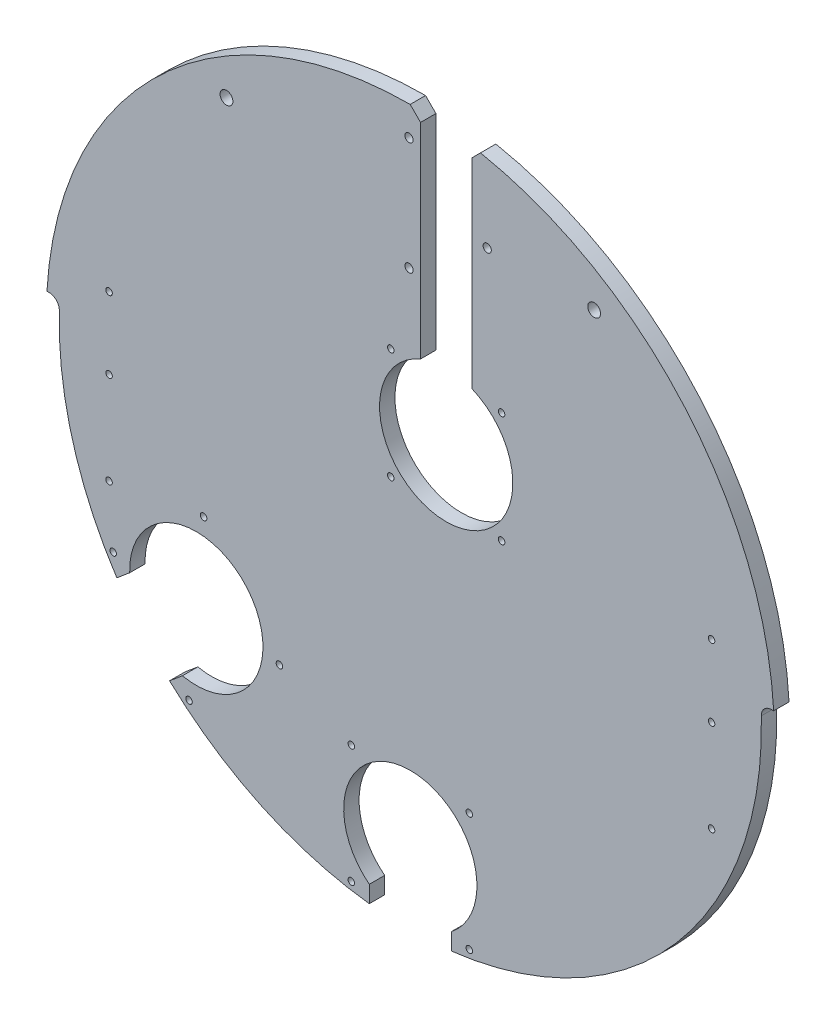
ISO-10303-21;
HEADER;
FILE_DESCRIPTION(('STEP AP214'),'2;1');
FILE_NAME('part.step','',(''),(''),'','','');
FILE_SCHEMA(('AUTOMOTIVE_DESIGN { 1 0 10303 214 1 1 1 1 }'));
ENDSEC;
DATA;
#1=APPLICATION_CONTEXT('core data for automotive mechanical design processes');
#2=APPLICATION_PROTOCOL_DEFINITION('international standard','automotive_design',2000,#1);
#3=PRODUCT_CONTEXT('',#1,'mechanical');
#4=PRODUCT('Part','Part','',(#3));
#5=PRODUCT_RELATED_PRODUCT_CATEGORY('part','',(#4));
#6=PRODUCT_DEFINITION_FORMATION('','',#4);
#7=PRODUCT_DEFINITION_CONTEXT('part definition',#1,'design');
#8=PRODUCT_DEFINITION('design','',#6,#7);
#9=PRODUCT_DEFINITION_SHAPE('','',#8);
#10=(LENGTH_UNIT() NAMED_UNIT(*) SI_UNIT(.MILLI.,.METRE.));
#11=(NAMED_UNIT(*) PLANE_ANGLE_UNIT() SI_UNIT($,.RADIAN.));
#12=(NAMED_UNIT(*) SI_UNIT($,.STERADIAN.) SOLID_ANGLE_UNIT());
#13=UNCERTAINTY_MEASURE_WITH_UNIT(LENGTH_MEASURE(1.E-05),#10,'distance_accuracy_value','');
#14=(GEOMETRIC_REPRESENTATION_CONTEXT(3) GLOBAL_UNCERTAINTY_ASSIGNED_CONTEXT((#13)) GLOBAL_UNIT_ASSIGNED_CONTEXT((#10,
#11,#12)) REPRESENTATION_CONTEXT('',''));
#15=CARTESIAN_POINT('',(0.,0.,0.));
#16=DIRECTION('',(0.,0.,1.));
#17=DIRECTION('',(1.,0.,0.));
#18=AXIS2_PLACEMENT_3D('',#15,#16,#17);
#19=CARTESIAN_POINT('',(0.,0.,4.7625));
#20=DIRECTION('',(0.,0.,-1.));
#21=DIRECTION('',(-1.,0.,0.));
#22=AXIS2_PLACEMENT_3D('',#19,#20,#21);
#23=CYLINDRICAL_SURFACE('',#22,217.4875);
#24=CARTESIAN_POINT('',(0.,0.,4.7625));
#25=DIRECTION('',(0.,0.,1.));
#26=DIRECTION('',(1.,0.,0.));
#27=AXIS2_PLACEMENT_3D('',#24,#25,#26);
#28=CIRCLE('',#27,217.4875);
#29=CARTESIAN_POINT('',(-149.138178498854,-158.299135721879,4.7625));
#30=VERTEX_POINT('',#29);
#31=CARTESIAN_POINT('',(-25.4,-215.999195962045,4.7625));
#32=VERTEX_POINT('',#31);
#33=EDGE_CURVE('E246',#30,#32,#28,.T.);
#34=ORIENTED_EDGE('',*,*,#33,.F.);
#35=DIRECTION('',(0.,0.,-1.));
#36=VECTOR('',#35,1.);
#37=CARTESIAN_POINT('',(-149.138178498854,-158.299135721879,4.7625));
#38=LINE('',#37,#36);
#39=CARTESIAN_POINT('',(-149.138178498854,-158.299135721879,-4.7625));
#40=VERTEX_POINT('',#39);
#41=EDGE_CURVE('E392',#30,#40,#38,.T.);
#42=ORIENTED_EDGE('',*,*,#41,.T.);
#43=CARTESIAN_POINT('',(0.,0.,-4.7625));
#44=DIRECTION('',(0.,0.,1.));
#45=DIRECTION('',(1.,0.,0.));
#46=AXIS2_PLACEMENT_3D('',#43,#44,#45);
#47=CIRCLE('',#46,217.4875);
#48=CARTESIAN_POINT('',(-25.4,-215.999195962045,-4.7625));
#49=VERTEX_POINT('',#48);
#50=EDGE_CURVE('E251',#40,#49,#47,.T.);
#51=ORIENTED_EDGE('',*,*,#50,.T.);
#52=DIRECTION('',(0.,0.,-1.));
#53=VECTOR('',#52,1.);
#54=CARTESIAN_POINT('',(-25.4,-215.999195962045,4.7625));
#55=LINE('',#54,#53);
#56=EDGE_CURVE('E403',#49,#32,#55,.F.);
#57=ORIENTED_EDGE('',*,*,#56,.T.);
#58=EDGE_LOOP('',(#34,#42,#51,#57));
#59=FACE_BOUND('',#58,.T.);
#60=ADVANCED_FACE('F41',(#59),#23,.T.);
#61=CARTESIAN_POINT('',(25.4,-215.999195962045,4.7625));
#62=VERTEX_POINT('',#61);
#63=CARTESIAN_POINT('',(217.399966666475,6.16985815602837,4.7625));
#64=VERTEX_POINT('',#63);
#65=EDGE_CURVE('E247',#62,#64,#28,.T.);
#66=ORIENTED_EDGE('',*,*,#65,.F.);
#67=DIRECTION('',(0.,0.,-1.));
#68=VECTOR('',#67,1.);
#69=CARTESIAN_POINT('',(25.4,-215.999195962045,4.7625));
#70=LINE('',#69,#68);
#71=CARTESIAN_POINT('',(25.4,-215.999195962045,-4.7625));
#72=VERTEX_POINT('',#71);
#73=EDGE_CURVE('E408',#62,#72,#70,.T.);
#74=ORIENTED_EDGE('',*,*,#73,.T.);
#75=CARTESIAN_POINT('',(217.399966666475,6.16985815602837,-4.7625));
#76=VERTEX_POINT('',#75);
#77=EDGE_CURVE('E243',#72,#76,#47,.T.);
#78=ORIENTED_EDGE('',*,*,#77,.T.);
#79=DIRECTION('',(0.,0.,-1.));
#80=VECTOR('',#79,1.);
#81=CARTESIAN_POINT('',(217.399966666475,6.16985815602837,4.7625));
#82=LINE('',#81,#80);
#83=EDGE_CURVE('E253',#76,#64,#82,.F.);
#84=ORIENTED_EDGE('',*,*,#83,.T.);
#85=EDGE_LOOP('',(#66,#74,#78,#84));
#86=FACE_BOUND('',#85,.T.);
#87=ADVANCED_FACE('F528',(#86),#23,.T.);
#88=CARTESIAN_POINT('',(0.,0.,-502.630442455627));
#89=DIRECTION('',(0.,0.,1.));
#90=DIRECTION('',(1.,0.,0.));
#91=AXIS2_PLACEMENT_3D('',#88,#89,#90);
#92=CYLINDRICAL_SURFACE('',#91,225.425);
#93=CARTESIAN_POINT('',(0.,0.,-4.7625));
#94=DIRECTION('',(0.,0.,1.));
#95=DIRECTION('',(1.,0.,0.));
#96=AXIS2_PLACEMENT_3D('',#93,#94,#95);
#97=CIRCLE('',#96,225.425);
#98=CARTESIAN_POINT('',(43.463360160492,221.195314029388,-4.7625));
#99=VERTEX_POINT('',#98);
#100=CARTESIAN_POINT('',(225.06696920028,12.7,-4.7625));
#101=VERTEX_POINT('',#100);
#102=EDGE_CURVE('E304',#99,#101,#97,.F.);
#103=ORIENTED_EDGE('',*,*,#102,.F.);
#104=DIRECTION('',(0.,0.,1.));
#105=VECTOR('',#104,1.);
#106=CARTESIAN_POINT('',(43.463360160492,221.195314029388,-502.630442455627));
#107=LINE('',#106,#105);
#108=CARTESIAN_POINT('',(43.463360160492,221.195314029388,4.7625));
#109=VERTEX_POINT('',#108);
#110=EDGE_CURVE('E186',#99,#109,#107,.T.);
#111=ORIENTED_EDGE('',*,*,#110,.T.);
#112=CARTESIAN_POINT('',(0.,0.,4.7625));
#113=DIRECTION('',(0.,0.,1.));
#114=DIRECTION('',(1.,0.,0.));
#115=AXIS2_PLACEMENT_3D('',#112,#113,#114);
#116=CIRCLE('',#115,225.425);
#117=CARTESIAN_POINT('',(225.06696920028,12.7,4.7625));
#118=VERTEX_POINT('',#117);
#119=EDGE_CURVE('E303',#118,#109,#116,.T.);
#120=ORIENTED_EDGE('',*,*,#119,.F.);
#121=DIRECTION('',(0.,0.,1.));
#122=VECTOR('',#121,1.);
#123=CARTESIAN_POINT('',(225.06696920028,12.7,-502.630442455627));
#124=LINE('',#123,#122);
#125=EDGE_CURVE('E360',#101,#118,#124,.T.);
#126=ORIENTED_EDGE('',*,*,#125,.F.);
#127=EDGE_LOOP('',(#103,#111,#120,#126));
#128=FACE_BOUND('',#127,.T.);
#129=ADVANCED_FACE('F301',(#128),#92,.T.);
#130=CARTESIAN_POINT('',(-217.399966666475,6.16985815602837,-4.7625));
#131=VERTEX_POINT('',#130);
#132=CARTESIAN_POINT('',(-181.79178907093,-119.384078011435,-4.7625));
#133=VERTEX_POINT('',#132);
#134=EDGE_CURVE('E248',#131,#133,#47,.T.);
#135=ORIENTED_EDGE('',*,*,#134,.T.);
#136=DIRECTION('',(0.,0.,-1.));
#137=VECTOR('',#136,1.);
#138=CARTESIAN_POINT('',(-181.79178907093,-119.384078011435,4.7625));
#139=LINE('',#138,#137);
#140=CARTESIAN_POINT('',(-181.79178907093,-119.384078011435,4.7625));
#141=VERTEX_POINT('',#140);
#142=EDGE_CURVE('E544',#133,#141,#139,.F.);
#143=ORIENTED_EDGE('',*,*,#142,.T.);
#144=CARTESIAN_POINT('',(-217.399966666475,6.16985815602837,4.7625));
#145=VERTEX_POINT('',#144);
#146=EDGE_CURVE('E194',#145,#141,#28,.T.);
#147=ORIENTED_EDGE('',*,*,#146,.F.);
#148=DIRECTION('',(0.,0.,-1.));
#149=VECTOR('',#148,1.);
#150=CARTESIAN_POINT('',(-217.399966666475,6.16985815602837,4.7625));
#151=LINE('',#150,#149);
#152=EDGE_CURVE('E245',#145,#131,#151,.T.);
#153=ORIENTED_EDGE('',*,*,#152,.T.);
#154=EDGE_LOOP('',(#135,#143,#147,#153));
#155=FACE_BOUND('',#154,.T.);
#156=ADVANCED_FACE('F493',(#155),#23,.T.);
#157=CARTESIAN_POINT('',(0.,0.,4.7625));
#158=DIRECTION('',(0.,0.,1.));
#159=DIRECTION('',(1.,0.,0.));
#160=AXIS2_PLACEMENT_3D('',#157,#158,#159);
#161=PLANE('',#160);
#162=CARTESIAN_POINT('',(-0.79375,207.16875,4.7625));
#163=DIRECTION('',(0.,0.,1.));
#164=DIRECTION('',(1.,0.,0.));
#165=AXIS2_PLACEMENT_3D('',#162,#163,#164);
#166=CIRCLE('',#165,2.55269999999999);
#167=CARTESIAN_POINT('',(1.75894999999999,207.16875,4.7625));
#168=VERTEX_POINT('',#167);
#169=EDGE_CURVE('E977',#168,#168,#166,.T.);
#170=ORIENTED_EDGE('',*,*,#169,.F.);
#171=EDGE_LOOP('',(#170));
#172=FACE_BOUND('',#171,.T.);
#173=CARTESIAN_POINT('',(-0.79375,137.31875,4.7625));
#174=DIRECTION('',(0.,0.,1.));
#175=DIRECTION('',(1.,0.,0.));
#176=AXIS2_PLACEMENT_3D('',#173,#174,#175);
#177=CIRCLE('',#176,2.55269999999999);
#178=CARTESIAN_POINT('',(1.75894999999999,137.31875,4.7625));
#179=VERTEX_POINT('',#178);
#180=EDGE_CURVE('E981',#179,#179,#177,.T.);
#181=ORIENTED_EDGE('',*,*,#180,.F.);
#182=EDGE_LOOP('',(#181));
#183=FACE_BOUND('',#182,.T.);
#184=CARTESIAN_POINT('',(47.625,172.24375,4.7625));
#185=DIRECTION('',(0.,0.,1.));
#186=DIRECTION('',(1.,0.,0.));
#187=AXIS2_PLACEMENT_3D('',#184,#185,#186);
#188=CIRCLE('',#187,2.55269999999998);
#189=CARTESIAN_POINT('',(50.1777,172.24375,4.7625));
#190=VERTEX_POINT('',#189);
#191=EDGE_CURVE('E989',#190,#190,#188,.T.);
#192=ORIENTED_EDGE('',*,*,#191,.F.);
#193=EDGE_LOOP('',(#192));
#194=FACE_BOUND('',#193,.T.);
#195=DIRECTION('',(0.766044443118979,0.642787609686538,0.));
#196=VECTOR('',#195,1.);
#197=CARTESIAN_POINT('',(-150.278285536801,-159.255799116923,4.7625));
#198=LINE('',#197,#196);
#199=CARTESIAN_POINT('',(-141.150152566,-151.596386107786,4.7625));
#200=VERTEX_POINT('',#199);
#201=EDGE_CURVE('E56',#30,#200,#198,.T.);
#202=ORIENTED_EDGE('',*,*,#201,.F.);
#203=ORIENTED_EDGE('',*,*,#33,.T.);
#204=DIRECTION('',(0.,-1.,0.));
#205=VECTOR('',#204,1.);
#206=CARTESIAN_POINT('',(-25.4,-205.289158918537,4.7625));
#207=LINE('',#206,#205);
#208=CARTESIAN_POINT('',(-25.4,-205.571568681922,4.7625));
#209=VERTEX_POINT('',#208);
#210=EDGE_CURVE('E387',#209,#32,#207,.T.);
#211=ORIENTED_EDGE('',*,*,#210,.F.);
#212=CARTESIAN_POINT('',(0.,-173.0375,4.7625));
#213=DIRECTION('',(0.,0.,1.));
#214=DIRECTION('',(1.,0.,0.));
#215=AXIS2_PLACEMENT_3D('',#212,#213,#214);
#216=CIRCLE('',#215,41.275);
#217=CARTESIAN_POINT('',(25.4,-205.571568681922,4.7625));
#218=VERTEX_POINT('',#217);
#219=EDGE_CURVE('E204',#218,#209,#216,.T.);
#220=ORIENTED_EDGE('',*,*,#219,.F.);
#221=DIRECTION('',(0.,1.,0.));
#222=VECTOR('',#221,1.);
#223=CARTESIAN_POINT('',(25.4,-217.4875,4.7625));
#224=LINE('',#223,#222);
#225=EDGE_CURVE('E384',#62,#218,#224,.T.);
#226=ORIENTED_EDGE('',*,*,#225,.F.);
#227=ORIENTED_EDGE('',*,*,#65,.T.);
#228=CARTESIAN_POINT('',(223.747410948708,6.35,4.7625));
#229=DIRECTION('',(0.,0.,1.));
#230=DIRECTION('',(1.,0.,0.));
#231=AXIS2_PLACEMENT_3D('',#228,#229,#230);
#232=CIRCLE('',#231,6.35);
#233=CARTESIAN_POINT('',(223.747410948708,12.7,4.7625));
#234=VERTEX_POINT('',#233);
#235=EDGE_CURVE('E261',#64,#234,#232,.F.);
#236=ORIENTED_EDGE('',*,*,#235,.T.);
#237=DIRECTION('',(1.,0.,0.));
#238=VECTOR('',#237,1.);
#239=CARTESIAN_POINT('',(217.116380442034,12.7,4.7625));
#240=LINE('',#239,#238);
#241=EDGE_CURVE('E310',#234,#118,#240,.T.);
#242=ORIENTED_EDGE('',*,*,#241,.T.);
#243=ORIENTED_EDGE('',*,*,#119,.T.);
#244=DIRECTION('',(-0.707106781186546,-0.707106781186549,0.));
#245=VECTOR('',#244,1.);
#246=CARTESIAN_POINT('',(-88.8659769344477,88.8659769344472,4.7625));
#247=LINE('',#246,#245);
#248=CARTESIAN_POINT('',(38.1,215.831953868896,4.7625));
#249=VERTEX_POINT('',#248);
#250=EDGE_CURVE('E280',#109,#249,#247,.T.);
#251=ORIENTED_EDGE('',*,*,#250,.T.);
#252=DIRECTION('',(0.,1.,0.));
#253=VECTOR('',#252,1.);
#254=CARTESIAN_POINT('',(38.1,53.975,4.7625));
#255=LINE('',#254,#253);
#256=CARTESIAN_POINT('',(38.1,92.075,4.7625));
#257=VERTEX_POINT('',#256);
#258=EDGE_CURVE('E321',#257,#249,#255,.T.);
#259=ORIENTED_EDGE('',*,*,#258,.F.);
#260=CARTESIAN_POINT('',(22.225,53.975,4.7625));
#261=DIRECTION('',(0.,0.,1.));
#262=DIRECTION('',(1.,0.,0.));
#263=AXIS2_PLACEMENT_3D('',#260,#261,#262);
#264=CIRCLE('',#263,41.275);
#265=CARTESIAN_POINT('',(6.34999999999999,92.075,4.7625));
#266=VERTEX_POINT('',#265);
#267=EDGE_CURVE('E374',#266,#257,#264,.T.);
#268=ORIENTED_EDGE('',*,*,#267,.F.);
#269=DIRECTION('',(0.,-1.,0.));
#270=VECTOR('',#269,1.);
#271=CARTESIAN_POINT('',(6.34999999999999,225.425,4.7625));
#272=LINE('',#271,#270);
#273=CARTESIAN_POINT('',(6.34999999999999,218.985545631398,4.7625));
#274=VERTEX_POINT('',#273);
#275=EDGE_CURVE('E339',#274,#266,#272,.T.);
#276=ORIENTED_EDGE('',*,*,#275,.F.);
#277=DIRECTION('',(0.707106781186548,-0.707106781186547,0.));
#278=VECTOR('',#277,1.);
#279=CARTESIAN_POINT('',(112.667772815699,112.667772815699,4.7625));
#280=LINE('',#279,#278);
#281=CARTESIAN_POINT('',(-0.0894366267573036,225.424982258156,4.7625));
#282=VERTEX_POINT('',#281);
#283=EDGE_CURVE('E282',#274,#282,#280,.F.);
#284=ORIENTED_EDGE('',*,*,#283,.T.);
#285=CARTESIAN_POINT('',(-225.06696920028,12.7,4.7625));
#286=VERTEX_POINT('',#285);
#287=EDGE_CURVE('E313',#282,#286,#116,.T.);
#288=ORIENTED_EDGE('',*,*,#287,.T.);
#289=DIRECTION('',(1.,0.,0.));
#290=VECTOR('',#289,1.);
#291=CARTESIAN_POINT('',(-225.06696920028,12.7,4.7625));
#292=LINE('',#291,#290);
#293=CARTESIAN_POINT('',(-223.747410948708,12.7,4.7625));
#294=VERTEX_POINT('',#293);
#295=EDGE_CURVE('E312',#286,#294,#292,.T.);
#296=ORIENTED_EDGE('',*,*,#295,.T.);
#297=CARTESIAN_POINT('',(-223.747410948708,6.35,4.7625));
#298=DIRECTION('',(0.,0.,1.));
#299=DIRECTION('',(1.,0.,0.));
#300=AXIS2_PLACEMENT_3D('',#297,#298,#299);
#301=CIRCLE('',#300,6.35);
#302=EDGE_CURVE('E266',#294,#145,#301,.F.);
#303=ORIENTED_EDGE('',*,*,#302,.T.);
#304=ORIENTED_EDGE('',*,*,#146,.T.);
#305=DIRECTION('',(-0.766044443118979,-0.642787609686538,0.));
#306=VECTOR('',#305,1.);
#307=CARTESIAN_POINT('',(-173.587424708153,-112.499798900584,4.7625));
#308=LINE('',#307,#306);
#309=CARTESIAN_POINT('',(-173.803763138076,-112.681328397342,4.7625));
#310=VERTEX_POINT('',#309);
#311=EDGE_CURVE('E180',#310,#141,#308,.T.);
#312=ORIENTED_EDGE('',*,*,#311,.F.);
#313=CARTESIAN_POINT('',(-132.5544153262,-111.226361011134,4.7625));
#314=DIRECTION('',(0.,0.,1.));
#315=DIRECTION('',(1.,0.,0.));
#316=AXIS2_PLACEMENT_3D('',#313,#314,#315);
#317=CIRCLE('',#316,41.2749999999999);
#318=EDGE_CURVE('E192',#200,#310,#317,.T.);
#319=ORIENTED_EDGE('',*,*,#318,.F.);
#320=EDGE_LOOP('',(#202,#203,#211,#220,#226,#227,#236,#242,#243,#251,#259,#268,#276,#284,#288,
#296,#303,#304,#312,#319));
#321=FACE_BOUND('',#320,.T.);
#322=CARTESIAN_POINT('',(-184.046723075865,-106.721367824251,4.7625));
#323=DIRECTION('',(0.,0.,1.));
#324=DIRECTION('',(1.,0.,0.));
#325=AXIS2_PLACEMENT_3D('',#322,#323,#324);
#326=CIRCLE('',#325,2.0193);
#327=CARTESIAN_POINT('',(-182.027423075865,-106.721367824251,4.7625));
#328=VERTEX_POINT('',#327);
#329=EDGE_CURVE('E411',#328,#328,#326,.T.);
#330=ORIENTED_EDGE('',*,*,#329,.F.);
#331=EDGE_LOOP('',(#330));
#332=FACE_BOUND('',#331,.T.);
#333=CARTESIAN_POINT('',(56.529578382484,19.6704216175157,4.7625));
#334=DIRECTION('',(0.,0.,1.));
#335=DIRECTION('',(1.,0.,0.));
#336=AXIS2_PLACEMENT_3D('',#333,#334,#335);
#337=CIRCLE('',#336,2.01929999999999);
#338=CARTESIAN_POINT('',(58.548878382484,19.6704216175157,4.7625));
#339=VERTEX_POINT('',#338);
#340=EDGE_CURVE('E417',#339,#339,#337,.T.);
#341=ORIENTED_EDGE('',*,*,#340,.F.);
#342=EDGE_LOOP('',(#341));
#343=FACE_BOUND('',#342,.T.);
#344=CARTESIAN_POINT('',(-137.059408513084,-162.718668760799,4.7625));
#345=DIRECTION('',(0.,0.,1.));
#346=DIRECTION('',(1.,0.,0.));
#347=AXIS2_PLACEMENT_3D('',#344,#345,#346);
#348=CIRCLE('',#347,2.0193);
#349=CARTESIAN_POINT('',(-135.040108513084,-162.718668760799,4.7625));
#350=VERTEX_POINT('',#349);
#351=EDGE_CURVE('E423',#350,#350,#348,.T.);
#352=ORIENTED_EDGE('',*,*,#351,.F.);
#353=EDGE_LOOP('',(#352));
#354=FACE_BOUND('',#353,.T.);
#355=CARTESIAN_POINT('',(-128.049422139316,-59.7340532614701,4.7625));
#356=DIRECTION('',(0.,0.,1.));
#357=DIRECTION('',(1.,0.,0.));
#358=AXIS2_PLACEMENT_3D('',#355,#356,#357);
#359=CIRCLE('',#358,2.01929999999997);
#360=CARTESIAN_POINT('',(-126.030122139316,-59.7340532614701,4.7625));
#361=VERTEX_POINT('',#360);
#362=EDGE_CURVE('E429',#361,#361,#359,.T.);
#363=ORIENTED_EDGE('',*,*,#362,.F.);
#364=EDGE_LOOP('',(#363));
#365=FACE_BOUND('',#364,.T.);
#366=CARTESIAN_POINT('',(-81.0621075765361,-115.731354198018,4.7625));
#367=DIRECTION('',(0.,0.,1.));
#368=DIRECTION('',(1.,0.,0.));
#369=AXIS2_PLACEMENT_3D('',#366,#367,#368);
#370=CIRCLE('',#369,2.01929999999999);
#371=CARTESIAN_POINT('',(-79.0428075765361,-115.731354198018,4.7625));
#372=VERTEX_POINT('',#371);
#373=EDGE_CURVE('E435',#372,#372,#370,.T.);
#374=ORIENTED_EDGE('',*,*,#373,.F.);
#375=EDGE_LOOP('',(#374));
#376=FACE_BOUND('',#375,.T.);
#377=CARTESIAN_POINT('',(-12.0795783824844,19.670421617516,4.7625));
#378=DIRECTION('',(0.,0.,1.));
#379=DIRECTION('',(1.,0.,0.));
#380=AXIS2_PLACEMENT_3D('',#377,#378,#379);
#381=CIRCLE('',#380,2.01929999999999);
#382=CARTESIAN_POINT('',(-10.0602783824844,19.670421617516,4.7625));
#383=VERTEX_POINT('',#382);
#384=EDGE_CURVE('E441',#383,#383,#381,.T.);
#385=ORIENTED_EDGE('',*,*,#384,.F.);
#386=EDGE_LOOP('',(#385));
#387=FACE_BOUND('',#386,.T.);
#388=CARTESIAN_POINT('',(56.5295783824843,88.279578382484,4.7625));
#389=DIRECTION('',(0.,0.,1.));
#390=DIRECTION('',(1.,0.,0.));
#391=AXIS2_PLACEMENT_3D('',#388,#389,#390);
#392=CIRCLE('',#391,2.01929999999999);
#393=CARTESIAN_POINT('',(58.5488783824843,88.279578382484,4.7625));
#394=VERTEX_POINT('',#393);
#395=EDGE_CURVE('E447',#394,#394,#392,.T.);
#396=ORIENTED_EDGE('',*,*,#395,.F.);
#397=EDGE_LOOP('',(#396));
#398=FACE_BOUND('',#397,.T.);
#399=CARTESIAN_POINT('',(-12.079578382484,88.2795783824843,4.7625));
#400=DIRECTION('',(0.,0.,1.));
#401=DIRECTION('',(1.,0.,0.));
#402=AXIS2_PLACEMENT_3D('',#399,#400,#401);
#403=CIRCLE('',#402,2.01929999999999);
#404=CARTESIAN_POINT('',(-10.060278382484,88.2795783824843,4.7625));
#405=VERTEX_POINT('',#404);
#406=EDGE_CURVE('E453',#405,#405,#403,.T.);
#407=ORIENTED_EDGE('',*,*,#406,.F.);
#408=EDGE_LOOP('',(#407));
#409=FACE_BOUND('',#408,.T.);
#410=CARTESIAN_POINT('',(36.5496424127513,-209.587142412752,4.7625));
#411=DIRECTION('',(0.,0.,1.));
#412=DIRECTION('',(1.,0.,0.));
#413=AXIS2_PLACEMENT_3D('',#410,#411,#412);
#414=CIRCLE('',#413,2.01929999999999);
#415=CARTESIAN_POINT('',(38.5689424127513,-209.587142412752,4.7625));
#416=VERTEX_POINT('',#415);
#417=EDGE_CURVE('E459',#416,#416,#414,.T.);
#418=ORIENTED_EDGE('',*,*,#417,.F.);
#419=EDGE_LOOP('',(#418));
#420=FACE_BOUND('',#419,.T.);
#421=CARTESIAN_POINT('',(-36.5496424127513,-209.587142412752,4.7625));
#422=DIRECTION('',(0.,0.,1.));
#423=DIRECTION('',(1.,0.,0.));
#424=AXIS2_PLACEMENT_3D('',#421,#422,#423);
#425=CIRCLE('',#424,2.01929999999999);
#426=CARTESIAN_POINT('',(-34.5303424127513,-209.587142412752,4.7625));
#427=VERTEX_POINT('',#426);
#428=EDGE_CURVE('E465',#427,#427,#425,.T.);
#429=ORIENTED_EDGE('',*,*,#428,.F.);
#430=EDGE_LOOP('',(#429));
#431=FACE_BOUND('',#430,.T.);
#432=CARTESIAN_POINT('',(-36.5496424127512,-136.487857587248,4.7625));
#433=DIRECTION('',(0.,0.,1.));
#434=DIRECTION('',(1.,0.,0.));
#435=AXIS2_PLACEMENT_3D('',#432,#433,#434);
#436=CIRCLE('',#435,2.01929999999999);
#437=CARTESIAN_POINT('',(-34.5303424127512,-136.487857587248,4.7625));
#438=VERTEX_POINT('',#437);
#439=EDGE_CURVE('E471',#438,#438,#436,.T.);
#440=ORIENTED_EDGE('',*,*,#439,.F.);
#441=EDGE_LOOP('',(#440));
#442=FACE_BOUND('',#441,.T.);
#443=CARTESIAN_POINT('',(36.5496424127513,-136.487857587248,4.7625));
#444=DIRECTION('',(0.,0.,1.));
#445=DIRECTION('',(1.,0.,0.));
#446=AXIS2_PLACEMENT_3D('',#443,#444,#445);
#447=CIRCLE('',#446,2.01929999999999);
#448=CARTESIAN_POINT('',(38.5689424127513,-136.487857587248,4.7625));
#449=VERTEX_POINT('',#448);
#450=EDGE_CURVE('E477',#449,#449,#447,.T.);
#451=ORIENTED_EDGE('',*,*,#450,.F.);
#452=EDGE_LOOP('',(#451));
#453=FACE_BOUND('',#452,.T.);
#454=CARTESIAN_POINT('',(113.869240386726,172.11750846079,4.7625));
#455=DIRECTION('',(0.,0.,1.));
#456=DIRECTION('',(1.,0.,0.));
#457=AXIS2_PLACEMENT_3D('',#454,#455,#456);
#458=CIRCLE('',#457,3.96874999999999);
#459=CARTESIAN_POINT('',(117.837990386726,172.11750846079,4.7625));
#460=VERTEX_POINT('',#459);
#461=EDGE_CURVE('E345',#460,#460,#458,.T.);
#462=ORIENTED_EDGE('',*,*,#461,.F.);
#463=EDGE_LOOP('',(#462));
#464=FACE_BOUND('',#463,.T.);
#465=CARTESIAN_POINT('',(-113.869240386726,172.11750846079,4.7625));
#466=DIRECTION('',(0.,0.,1.));
#467=DIRECTION('',(1.,0.,0.));
#468=AXIS2_PLACEMENT_3D('',#465,#466,#467);
#469=CIRCLE('',#468,3.96874999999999);
#470=CARTESIAN_POINT('',(-109.900490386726,172.11750846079,4.7625));
#471=VERTEX_POINT('',#470);
#472=EDGE_CURVE('E351',#471,#471,#469,.T.);
#473=ORIENTED_EDGE('',*,*,#472,.F.);
#474=EDGE_LOOP('',(#473));
#475=FACE_BOUND('',#474,.T.);
#476=CARTESIAN_POINT('',(-186.59475,-69.85,4.7625));
#477=DIRECTION('',(0.,0.,1.));
#478=DIRECTION('',(1.,0.,0.));
#479=AXIS2_PLACEMENT_3D('',#476,#477,#478);
#480=CIRCLE('',#479,2.0193);
#481=CARTESIAN_POINT('',(-184.57545,-69.85,4.7625));
#482=VERTEX_POINT('',#481);
#483=EDGE_CURVE('E201',#482,#482,#480,.T.);
#484=ORIENTED_EDGE('',*,*,#483,.F.);
#485=EDGE_LOOP('',(#484));
#486=FACE_BOUND('',#485,.T.);
#487=CARTESIAN_POINT('',(-186.59475,31.75,4.7625));
#488=DIRECTION('',(0.,0.,1.));
#489=DIRECTION('',(1.,0.,0.));
#490=AXIS2_PLACEMENT_3D('',#487,#488,#489);
#491=CIRCLE('',#490,2.0193);
#492=CARTESIAN_POINT('',(-184.57545,31.75,4.7625));
#493=VERTEX_POINT('',#492);
#494=EDGE_CURVE('E213',#493,#493,#491,.T.);
#495=ORIENTED_EDGE('',*,*,#494,.F.);
#496=EDGE_LOOP('',(#495));
#497=FACE_BOUND('',#496,.T.);
#498=CARTESIAN_POINT('',(186.59475,-69.85,4.7625));
#499=DIRECTION('',(0.,0.,1.));
#500=DIRECTION('',(1.,0.,0.));
#501=AXIS2_PLACEMENT_3D('',#498,#499,#500);
#502=CIRCLE('',#501,2.0193);
#503=CARTESIAN_POINT('',(188.61405,-69.85,4.7625));
#504=VERTEX_POINT('',#503);
#505=EDGE_CURVE('E219',#504,#504,#502,.T.);
#506=ORIENTED_EDGE('',*,*,#505,.F.);
#507=EDGE_LOOP('',(#506));
#508=FACE_BOUND('',#507,.T.);
#509=CARTESIAN_POINT('',(186.59475,31.7500000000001,4.7625));
#510=DIRECTION('',(0.,0.,1.));
#511=DIRECTION('',(1.,0.,0.));
#512=AXIS2_PLACEMENT_3D('',#509,#510,#511);
#513=CIRCLE('',#512,2.0193);
#514=CARTESIAN_POINT('',(188.61405,31.7500000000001,4.7625));
#515=VERTEX_POINT('',#514);
#516=EDGE_CURVE('E225',#515,#515,#513,.T.);
#517=ORIENTED_EDGE('',*,*,#516,.F.);
#518=EDGE_LOOP('',(#517));
#519=FACE_BOUND('',#518,.T.);
#520=CARTESIAN_POINT('',(-186.59475,-12.7,4.7625));
#521=DIRECTION('',(0.,0.,1.));
#522=DIRECTION('',(1.,0.,0.));
#523=AXIS2_PLACEMENT_3D('',#520,#521,#522);
#524=CIRCLE('',#523,2.0193);
#525=CARTESIAN_POINT('',(-184.57545,-12.7,4.7625));
#526=VERTEX_POINT('',#525);
#527=EDGE_CURVE('E231',#526,#526,#524,.T.);
#528=ORIENTED_EDGE('',*,*,#527,.F.);
#529=EDGE_LOOP('',(#528));
#530=FACE_BOUND('',#529,.T.);
#531=CARTESIAN_POINT('',(186.59475,-12.6999999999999,4.7625));
#532=DIRECTION('',(0.,0.,1.));
#533=DIRECTION('',(1.,0.,0.));
#534=AXIS2_PLACEMENT_3D('',#531,#532,#533);
#535=CIRCLE('',#534,2.0193);
#536=CARTESIAN_POINT('',(188.61405,-12.6999999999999,4.7625));
#537=VERTEX_POINT('',#536);
#538=EDGE_CURVE('E237',#537,#537,#535,.T.);
#539=ORIENTED_EDGE('',*,*,#538,.F.);
#540=EDGE_LOOP('',(#539));
#541=FACE_BOUND('',#540,.T.);
#542=ADVANCED_FACE('F190',(#172,#183,#194,#321,#332,#343,#354,#365,#376,#387,#398,#409,#420,
#431,#442,#453,#464,#475,#486,#497,#508,#519,#530,#541),#161,.T.);
#543=CARTESIAN_POINT('',(0.,0.,-4.7625));
#544=DIRECTION('',(0.,0.,1.));
#545=DIRECTION('',(1.,0.,0.));
#546=AXIS2_PLACEMENT_3D('',#543,#544,#545);
#547=PLANE('',#546);
#548=CARTESIAN_POINT('',(-0.79375,207.16875,-4.76250000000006));
#549=DIRECTION('',(0.,0.,1.));
#550=DIRECTION('',(1.,0.,0.));
#551=AXIS2_PLACEMENT_3D('',#548,#549,#550);
#552=CIRCLE('',#551,2.5527);
#553=CARTESIAN_POINT('',(1.75895,207.16875,-4.76250000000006));
#554=VERTEX_POINT('',#553);
#555=EDGE_CURVE('E974',#554,#554,#552,.T.);
#556=ORIENTED_EDGE('',*,*,#555,.T.);
#557=EDGE_LOOP('',(#556));
#558=FACE_BOUND('',#557,.T.);
#559=CARTESIAN_POINT('',(-0.79375,137.31875,-4.76250000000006));
#560=DIRECTION('',(0.,0.,1.));
#561=DIRECTION('',(1.,0.,0.));
#562=AXIS2_PLACEMENT_3D('',#559,#560,#561);
#563=CIRCLE('',#562,2.5527);
#564=CARTESIAN_POINT('',(1.75895,137.31875,-4.76250000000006));
#565=VERTEX_POINT('',#564);
#566=EDGE_CURVE('E986',#565,#565,#563,.T.);
#567=ORIENTED_EDGE('',*,*,#566,.T.);
#568=EDGE_LOOP('',(#567));
#569=FACE_BOUND('',#568,.T.);
#570=CARTESIAN_POINT('',(47.625,172.24375,-4.76250000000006));
#571=DIRECTION('',(0.,0.,1.));
#572=DIRECTION('',(1.,0.,0.));
#573=AXIS2_PLACEMENT_3D('',#570,#571,#572);
#574=CIRCLE('',#573,2.5527);
#575=CARTESIAN_POINT('',(50.1777,172.24375,-4.76250000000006));
#576=VERTEX_POINT('',#575);
#577=EDGE_CURVE('E195',#576,#576,#574,.T.);
#578=ORIENTED_EDGE('',*,*,#577,.T.);
#579=EDGE_LOOP('',(#578));
#580=FACE_BOUND('',#579,.T.);
#581=CARTESIAN_POINT('',(-184.046723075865,-106.721367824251,-4.7625));
#582=DIRECTION('',(0.,0.,1.));
#583=DIRECTION('',(1.,0.,0.));
#584=AXIS2_PLACEMENT_3D('',#581,#582,#583);
#585=CIRCLE('',#584,2.0193);
#586=CARTESIAN_POINT('',(-182.027423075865,-106.721367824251,-4.7625));
#587=VERTEX_POINT('',#586);
#588=EDGE_CURVE('E414',#587,#587,#585,.T.);
#589=ORIENTED_EDGE('',*,*,#588,.T.);
#590=EDGE_LOOP('',(#589));
#591=FACE_BOUND('',#590,.T.);
#592=CARTESIAN_POINT('',(56.529578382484,19.6704216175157,-4.7625));
#593=DIRECTION('',(0.,0.,1.));
#594=DIRECTION('',(1.,0.,0.));
#595=AXIS2_PLACEMENT_3D('',#592,#593,#594);
#596=CIRCLE('',#595,2.01929999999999);
#597=CARTESIAN_POINT('',(58.548878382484,19.6704216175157,-4.7625));
#598=VERTEX_POINT('',#597);
#599=EDGE_CURVE('E420',#598,#598,#596,.T.);
#600=ORIENTED_EDGE('',*,*,#599,.T.);
#601=EDGE_LOOP('',(#600));
#602=FACE_BOUND('',#601,.T.);
#603=CARTESIAN_POINT('',(-137.059408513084,-162.718668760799,-4.7625));
#604=DIRECTION('',(0.,0.,1.));
#605=DIRECTION('',(1.,0.,0.));
#606=AXIS2_PLACEMENT_3D('',#603,#604,#605);
#607=CIRCLE('',#606,2.0193);
#608=CARTESIAN_POINT('',(-135.040108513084,-162.718668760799,-4.7625));
#609=VERTEX_POINT('',#608);
#610=EDGE_CURVE('E426',#609,#609,#607,.T.);
#611=ORIENTED_EDGE('',*,*,#610,.T.);
#612=EDGE_LOOP('',(#611));
#613=FACE_BOUND('',#612,.T.);
#614=CARTESIAN_POINT('',(-128.049422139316,-59.7340532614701,-4.7625));
#615=DIRECTION('',(0.,0.,1.));
#616=DIRECTION('',(1.,0.,0.));
#617=AXIS2_PLACEMENT_3D('',#614,#615,#616);
#618=CIRCLE('',#617,2.0193);
#619=CARTESIAN_POINT('',(-126.030122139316,-59.7340532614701,-4.7625));
#620=VERTEX_POINT('',#619);
#621=EDGE_CURVE('E432',#620,#620,#618,.T.);
#622=ORIENTED_EDGE('',*,*,#621,.T.);
#623=EDGE_LOOP('',(#622));
#624=FACE_BOUND('',#623,.T.);
#625=CARTESIAN_POINT('',(-81.0621075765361,-115.731354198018,-4.7625));
#626=DIRECTION('',(0.,0.,1.));
#627=DIRECTION('',(1.,0.,0.));
#628=AXIS2_PLACEMENT_3D('',#625,#626,#627);
#629=CIRCLE('',#628,2.0193);
#630=CARTESIAN_POINT('',(-79.0428075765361,-115.731354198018,-4.7625));
#631=VERTEX_POINT('',#630);
#632=EDGE_CURVE('E438',#631,#631,#629,.T.);
#633=ORIENTED_EDGE('',*,*,#632,.T.);
#634=EDGE_LOOP('',(#633));
#635=FACE_BOUND('',#634,.T.);
#636=CARTESIAN_POINT('',(-12.0795783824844,19.670421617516,-4.7625));
#637=DIRECTION('',(0.,0.,1.));
#638=DIRECTION('',(1.,0.,0.));
#639=AXIS2_PLACEMENT_3D('',#636,#637,#638);
#640=CIRCLE('',#639,2.0193);
#641=CARTESIAN_POINT('',(-10.0602783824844,19.670421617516,-4.7625));
#642=VERTEX_POINT('',#641);
#643=EDGE_CURVE('E444',#642,#642,#640,.T.);
#644=ORIENTED_EDGE('',*,*,#643,.T.);
#645=EDGE_LOOP('',(#644));
#646=FACE_BOUND('',#645,.T.);
#647=CARTESIAN_POINT('',(56.5295783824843,88.279578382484,-4.7625));
#648=DIRECTION('',(0.,0.,1.));
#649=DIRECTION('',(1.,0.,0.));
#650=AXIS2_PLACEMENT_3D('',#647,#648,#649);
#651=CIRCLE('',#650,2.01929999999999);
#652=CARTESIAN_POINT('',(58.5488783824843,88.279578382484,-4.7625));
#653=VERTEX_POINT('',#652);
#654=EDGE_CURVE('E450',#653,#653,#651,.T.);
#655=ORIENTED_EDGE('',*,*,#654,.T.);
#656=EDGE_LOOP('',(#655));
#657=FACE_BOUND('',#656,.T.);
#658=CARTESIAN_POINT('',(-12.079578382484,88.2795783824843,-4.7625));
#659=DIRECTION('',(0.,0.,1.));
#660=DIRECTION('',(1.,0.,0.));
#661=AXIS2_PLACEMENT_3D('',#658,#659,#660);
#662=CIRCLE('',#661,2.0193);
#663=CARTESIAN_POINT('',(-10.060278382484,88.2795783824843,-4.7625));
#664=VERTEX_POINT('',#663);
#665=EDGE_CURVE('E456',#664,#664,#662,.T.);
#666=ORIENTED_EDGE('',*,*,#665,.T.);
#667=EDGE_LOOP('',(#666));
#668=FACE_BOUND('',#667,.T.);
#669=CARTESIAN_POINT('',(36.5496424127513,-209.587142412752,-4.7625));
#670=DIRECTION('',(0.,0.,1.));
#671=DIRECTION('',(1.,0.,0.));
#672=AXIS2_PLACEMENT_3D('',#669,#670,#671);
#673=CIRCLE('',#672,2.01929999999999);
#674=CARTESIAN_POINT('',(38.5689424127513,-209.587142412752,-4.7625));
#675=VERTEX_POINT('',#674);
#676=EDGE_CURVE('E462',#675,#675,#673,.T.);
#677=ORIENTED_EDGE('',*,*,#676,.T.);
#678=EDGE_LOOP('',(#677));
#679=FACE_BOUND('',#678,.T.);
#680=CARTESIAN_POINT('',(-36.5496424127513,-209.587142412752,-4.7625));
#681=DIRECTION('',(0.,0.,1.));
#682=DIRECTION('',(1.,0.,0.));
#683=AXIS2_PLACEMENT_3D('',#680,#681,#682);
#684=CIRCLE('',#683,2.01929999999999);
#685=CARTESIAN_POINT('',(-34.5303424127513,-209.587142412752,-4.7625));
#686=VERTEX_POINT('',#685);
#687=EDGE_CURVE('E468',#686,#686,#684,.T.);
#688=ORIENTED_EDGE('',*,*,#687,.T.);
#689=EDGE_LOOP('',(#688));
#690=FACE_BOUND('',#689,.T.);
#691=CARTESIAN_POINT('',(-36.5496424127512,-136.487857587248,-4.7625));
#692=DIRECTION('',(0.,0.,1.));
#693=DIRECTION('',(1.,0.,0.));
#694=AXIS2_PLACEMENT_3D('',#691,#692,#693);
#695=CIRCLE('',#694,2.01929999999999);
#696=CARTESIAN_POINT('',(-34.5303424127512,-136.487857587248,-4.7625));
#697=VERTEX_POINT('',#696);
#698=EDGE_CURVE('E474',#697,#697,#695,.T.);
#699=ORIENTED_EDGE('',*,*,#698,.T.);
#700=EDGE_LOOP('',(#699));
#701=FACE_BOUND('',#700,.T.);
#702=CARTESIAN_POINT('',(36.5496424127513,-136.487857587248,-4.7625));
#703=DIRECTION('',(0.,0.,1.));
#704=DIRECTION('',(1.,0.,0.));
#705=AXIS2_PLACEMENT_3D('',#702,#703,#704);
#706=CIRCLE('',#705,2.01929999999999);
#707=CARTESIAN_POINT('',(38.5689424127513,-136.487857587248,-4.7625));
#708=VERTEX_POINT('',#707);
#709=EDGE_CURVE('E342',#708,#708,#706,.T.);
#710=ORIENTED_EDGE('',*,*,#709,.T.);
#711=EDGE_LOOP('',(#710));
#712=FACE_BOUND('',#711,.T.);
#713=CARTESIAN_POINT('',(113.869240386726,172.11750846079,-4.7625));
#714=DIRECTION('',(0.,0.,1.));
#715=DIRECTION('',(1.,0.,0.));
#716=AXIS2_PLACEMENT_3D('',#713,#714,#715);
#717=CIRCLE('',#716,3.96874999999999);
#718=CARTESIAN_POINT('',(117.837990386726,172.11750846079,-4.7625));
#719=VERTEX_POINT('',#718);
#720=EDGE_CURVE('E348',#719,#719,#717,.T.);
#721=ORIENTED_EDGE('',*,*,#720,.T.);
#722=EDGE_LOOP('',(#721));
#723=FACE_BOUND('',#722,.T.);
#724=CARTESIAN_POINT('',(-113.869240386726,172.11750846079,-4.7625));
#725=DIRECTION('',(0.,0.,1.));
#726=DIRECTION('',(1.,0.,0.));
#727=AXIS2_PLACEMENT_3D('',#724,#725,#726);
#728=CIRCLE('',#727,3.96874999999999);
#729=CARTESIAN_POINT('',(-109.900490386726,172.11750846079,-4.7625));
#730=VERTEX_POINT('',#729);
#731=EDGE_CURVE('E354',#730,#730,#728,.T.);
#732=ORIENTED_EDGE('',*,*,#731,.T.);
#733=EDGE_LOOP('',(#732));
#734=FACE_BOUND('',#733,.T.);
#735=ORIENTED_EDGE('',*,*,#50,.F.);
#736=DIRECTION('',(0.766044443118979,0.642787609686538,0.));
#737=VECTOR('',#736,1.);
#738=CARTESIAN_POINT('',(16.326805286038,-19.4575288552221,-4.7625));
#739=LINE('',#738,#737);
#740=CARTESIAN_POINT('',(-141.150152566,-151.596386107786,-4.7625));
#741=VERTEX_POINT('',#740);
#742=EDGE_CURVE('E397',#40,#741,#739,.T.);
#743=ORIENTED_EDGE('',*,*,#742,.T.);
#744=CARTESIAN_POINT('',(-132.5544153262,-111.226361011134,-4.7625));
#745=DIRECTION('',(0.,0.,1.));
#746=DIRECTION('',(1.,0.,0.));
#747=AXIS2_PLACEMENT_3D('',#744,#745,#746);
#748=CIRCLE('',#747,41.2749999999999);
#749=CARTESIAN_POINT('',(-173.803763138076,-112.681328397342,-4.7625));
#750=VERTEX_POINT('',#749);
#751=EDGE_CURVE('E198',#741,#750,#748,.T.);
#752=ORIENTED_EDGE('',*,*,#751,.T.);
#753=DIRECTION('',(-0.766044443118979,-0.642787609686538,0.));
#754=VECTOR('',#753,1.);
#755=CARTESIAN_POINT('',(-16.3268052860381,19.4575288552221,-4.7625));
#756=LINE('',#755,#754);
#757=EDGE_CURVE('E63',#750,#133,#756,.T.);
#758=ORIENTED_EDGE('',*,*,#757,.T.);
#759=ORIENTED_EDGE('',*,*,#134,.F.);
#760=CARTESIAN_POINT('',(-223.747410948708,6.35,-4.7625));
#761=DIRECTION('',(0.,0.,1.));
#762=DIRECTION('',(1.,0.,0.));
#763=AXIS2_PLACEMENT_3D('',#760,#761,#762);
#764=CIRCLE('',#763,6.35);
#765=CARTESIAN_POINT('',(-223.747410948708,12.7,-4.7625));
#766=VERTEX_POINT('',#765);
#767=EDGE_CURVE('E268',#131,#766,#764,.T.);
#768=ORIENTED_EDGE('',*,*,#767,.T.);
#769=DIRECTION('',(-1.,0.,0.));
#770=VECTOR('',#769,1.);
#771=CARTESIAN_POINT('',(-225.06696920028,12.7,-4.7625));
#772=LINE('',#771,#770);
#773=CARTESIAN_POINT('',(-225.06696920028,12.7,-4.7625));
#774=VERTEX_POINT('',#773);
#775=EDGE_CURVE('E364',#766,#774,#772,.T.);
#776=ORIENTED_EDGE('',*,*,#775,.T.);
#777=CARTESIAN_POINT('',(-0.0894366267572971,225.424982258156,-4.7625));
#778=VERTEX_POINT('',#777);
#779=EDGE_CURVE('E361',#774,#778,#97,.F.);
#780=ORIENTED_EDGE('',*,*,#779,.T.);
#781=DIRECTION('',(-0.707106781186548,0.707106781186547,0.));
#782=VECTOR('',#781,1.);
#783=CARTESIAN_POINT('',(6.34999999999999,218.985545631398,-4.7625));
#784=LINE('',#783,#782);
#785=CARTESIAN_POINT('',(6.34999999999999,218.985545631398,-4.7625));
#786=VERTEX_POINT('',#785);
#787=EDGE_CURVE('E290',#778,#786,#784,.F.);
#788=ORIENTED_EDGE('',*,*,#787,.T.);
#789=DIRECTION('',(0.,-1.,0.));
#790=VECTOR('',#789,1.);
#791=CARTESIAN_POINT('',(6.34999999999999,225.425,-4.7625));
#792=LINE('',#791,#790);
#793=CARTESIAN_POINT('',(6.34999999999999,92.075,-4.7625));
#794=VERTEX_POINT('',#793);
#795=EDGE_CURVE('E330',#786,#794,#792,.T.);
#796=ORIENTED_EDGE('',*,*,#795,.T.);
#797=CARTESIAN_POINT('',(22.225,53.975,-4.7625));
#798=DIRECTION('',(0.,0.,1.));
#799=DIRECTION('',(1.,0.,0.));
#800=AXIS2_PLACEMENT_3D('',#797,#798,#799);
#801=CIRCLE('',#800,41.275);
#802=CARTESIAN_POINT('',(38.1,92.075,-4.7625));
#803=VERTEX_POINT('',#802);
#804=EDGE_CURVE('E328',#794,#803,#801,.T.);
#805=ORIENTED_EDGE('',*,*,#804,.T.);
#806=DIRECTION('',(0.,1.,0.));
#807=VECTOR('',#806,1.);
#808=CARTESIAN_POINT('',(38.1,53.975,-4.7625));
#809=LINE('',#808,#807);
#810=CARTESIAN_POINT('',(38.1,215.831953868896,-4.7625));
#811=VERTEX_POINT('',#810);
#812=EDGE_CURVE('E319',#803,#811,#809,.T.);
#813=ORIENTED_EDGE('',*,*,#812,.T.);
#814=DIRECTION('',(0.707106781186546,0.707106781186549,0.));
#815=VECTOR('',#814,1.);
#816=CARTESIAN_POINT('',(38.1,215.831953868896,-4.7625));
#817=LINE('',#816,#815);
#818=EDGE_CURVE('E288',#811,#99,#817,.T.);
#819=ORIENTED_EDGE('',*,*,#818,.T.);
#820=ORIENTED_EDGE('',*,*,#102,.T.);
#821=DIRECTION('',(-1.,0.,0.));
#822=VECTOR('',#821,1.);
#823=CARTESIAN_POINT('',(217.116380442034,12.7,-4.7625));
#824=LINE('',#823,#822);
#825=CARTESIAN_POINT('',(223.747410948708,12.7,-4.7625));
#826=VERTEX_POINT('',#825);
#827=EDGE_CURVE('E357',#101,#826,#824,.T.);
#828=ORIENTED_EDGE('',*,*,#827,.T.);
#829=CARTESIAN_POINT('',(223.747410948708,6.35,-4.7625));
#830=DIRECTION('',(0.,0.,1.));
#831=DIRECTION('',(1.,0.,0.));
#832=AXIS2_PLACEMENT_3D('',#829,#830,#831);
#833=CIRCLE('',#832,6.35);
#834=EDGE_CURVE('E263',#826,#76,#833,.T.);
#835=ORIENTED_EDGE('',*,*,#834,.T.);
#836=ORIENTED_EDGE('',*,*,#77,.F.);
#837=DIRECTION('',(0.,1.,0.));
#838=VECTOR('',#837,1.);
#839=CARTESIAN_POINT('',(25.4,0.,-4.7625));
#840=LINE('',#839,#838);
#841=CARTESIAN_POINT('',(25.4,-205.571568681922,-4.7625));
#842=VERTEX_POINT('',#841);
#843=EDGE_CURVE('E405',#72,#842,#840,.T.);
#844=ORIENTED_EDGE('',*,*,#843,.T.);
#845=CARTESIAN_POINT('',(0.,-173.0375,-4.7625));
#846=DIRECTION('',(0.,0.,1.));
#847=DIRECTION('',(1.,0.,0.));
#848=AXIS2_PLACEMENT_3D('',#845,#846,#847);
#849=CIRCLE('',#848,41.275);
#850=CARTESIAN_POINT('',(-25.4,-205.571568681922,-4.7625));
#851=VERTEX_POINT('',#850);
#852=EDGE_CURVE('E199',#842,#851,#849,.T.);
#853=ORIENTED_EDGE('',*,*,#852,.T.);
#854=DIRECTION('',(0.,-1.,0.));
#855=VECTOR('',#854,1.);
#856=CARTESIAN_POINT('',(-25.4,0.,-4.7625));
#857=LINE('',#856,#855);
#858=EDGE_CURVE('E394',#851,#49,#857,.T.);
#859=ORIENTED_EDGE('',*,*,#858,.T.);
#860=EDGE_LOOP('',(#735,#743,#752,#758,#759,#768,#776,#780,#788,#796,#805,#813,#819,#820,#828,
#835,#836,#844,#853,#859));
#861=FACE_BOUND('',#860,.T.);
#862=CARTESIAN_POINT('',(-186.59475,-69.85,-4.7625));
#863=DIRECTION('',(0.,0.,1.));
#864=DIRECTION('',(1.,0.,0.));
#865=AXIS2_PLACEMENT_3D('',#862,#863,#864);
#866=CIRCLE('',#865,2.0193);
#867=CARTESIAN_POINT('',(-184.57545,-69.85,-4.7625));
#868=VERTEX_POINT('',#867);
#869=EDGE_CURVE('E210',#868,#868,#866,.T.);
#870=ORIENTED_EDGE('',*,*,#869,.T.);
#871=EDGE_LOOP('',(#870));
#872=FACE_BOUND('',#871,.T.);
#873=CARTESIAN_POINT('',(-186.59475,31.75,-4.7625));
#874=DIRECTION('',(0.,0.,1.));
#875=DIRECTION('',(1.,0.,0.));
#876=AXIS2_PLACEMENT_3D('',#873,#874,#875);
#877=CIRCLE('',#876,2.0193);
#878=CARTESIAN_POINT('',(-184.57545,31.75,-4.7625));
#879=VERTEX_POINT('',#878);
#880=EDGE_CURVE('E216',#879,#879,#877,.T.);
#881=ORIENTED_EDGE('',*,*,#880,.T.);
#882=EDGE_LOOP('',(#881));
#883=FACE_BOUND('',#882,.T.);
#884=CARTESIAN_POINT('',(186.59475,-69.85,-4.7625));
#885=DIRECTION('',(0.,0.,1.));
#886=DIRECTION('',(1.,0.,0.));
#887=AXIS2_PLACEMENT_3D('',#884,#885,#886);
#888=CIRCLE('',#887,2.0193);
#889=CARTESIAN_POINT('',(188.61405,-69.85,-4.7625));
#890=VERTEX_POINT('',#889);
#891=EDGE_CURVE('E222',#890,#890,#888,.T.);
#892=ORIENTED_EDGE('',*,*,#891,.T.);
#893=EDGE_LOOP('',(#892));
#894=FACE_BOUND('',#893,.T.);
#895=CARTESIAN_POINT('',(186.59475,31.7500000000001,-4.7625));
#896=DIRECTION('',(0.,0.,1.));
#897=DIRECTION('',(1.,0.,0.));
#898=AXIS2_PLACEMENT_3D('',#895,#896,#897);
#899=CIRCLE('',#898,2.0193);
#900=CARTESIAN_POINT('',(188.61405,31.7500000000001,-4.7625));
#901=VERTEX_POINT('',#900);
#902=EDGE_CURVE('E228',#901,#901,#899,.T.);
#903=ORIENTED_EDGE('',*,*,#902,.T.);
#904=EDGE_LOOP('',(#903));
#905=FACE_BOUND('',#904,.T.);
#906=CARTESIAN_POINT('',(-186.59475,-12.7,-4.7625));
#907=DIRECTION('',(0.,0.,1.));
#908=DIRECTION('',(1.,0.,0.));
#909=AXIS2_PLACEMENT_3D('',#906,#907,#908);
#910=CIRCLE('',#909,2.0193);
#911=CARTESIAN_POINT('',(-184.57545,-12.7,-4.7625));
#912=VERTEX_POINT('',#911);
#913=EDGE_CURVE('E234',#912,#912,#910,.T.);
#914=ORIENTED_EDGE('',*,*,#913,.T.);
#915=EDGE_LOOP('',(#914));
#916=FACE_BOUND('',#915,.T.);
#917=CARTESIAN_POINT('',(186.59475,-12.6999999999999,-4.7625));
#918=DIRECTION('',(0.,0.,1.));
#919=DIRECTION('',(1.,0.,0.));
#920=AXIS2_PLACEMENT_3D('',#917,#918,#919);
#921=CIRCLE('',#920,2.0193);
#922=CARTESIAN_POINT('',(188.61405,-12.6999999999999,-4.7625));
#923=VERTEX_POINT('',#922);
#924=EDGE_CURVE('E240',#923,#923,#921,.T.);
#925=ORIENTED_EDGE('',*,*,#924,.T.);
#926=EDGE_LOOP('',(#925));
#927=FACE_BOUND('',#926,.T.);
#928=ADVANCED_FACE('F325',(#558,#569,#580,#591,#602,#613,#624,#635,#646,#657,#668,#679,#690,
#701,#712,#723,#734,#861,#872,#883,#894,#905,#916,#927),#547,.F.);
#929=CARTESIAN_POINT('',(186.59475,-12.6999999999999,4.7625));
#930=DIRECTION('',(0.,0.,1.));
#931=DIRECTION('',(1.,0.,0.));
#932=AXIS2_PLACEMENT_3D('',#929,#930,#931);
#933=CYLINDRICAL_SURFACE('',#932,2.0193);
#934=ORIENTED_EDGE('',*,*,#924,.F.);
#935=EDGE_LOOP('',(#934));
#936=FACE_BOUND('',#935,.T.);
#937=ORIENTED_EDGE('',*,*,#538,.T.);
#938=EDGE_LOOP('',(#937));
#939=FACE_BOUND('',#938,.T.);
#940=ADVANCED_FACE('F512',(#936,#939),#933,.F.);
#941=CARTESIAN_POINT('',(-186.59475,-12.7,4.7625));
#942=DIRECTION('',(0.,0.,1.));
#943=DIRECTION('',(1.,0.,0.));
#944=AXIS2_PLACEMENT_3D('',#941,#942,#943);
#945=CYLINDRICAL_SURFACE('',#944,2.0193);
#946=ORIENTED_EDGE('',*,*,#913,.F.);
#947=EDGE_LOOP('',(#946));
#948=FACE_BOUND('',#947,.T.);
#949=ORIENTED_EDGE('',*,*,#527,.T.);
#950=EDGE_LOOP('',(#949));
#951=FACE_BOUND('',#950,.T.);
#952=ADVANCED_FACE('F514',(#948,#951),#945,.F.);
#953=CARTESIAN_POINT('',(186.59475,31.7500000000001,4.7625));
#954=DIRECTION('',(0.,0.,1.));
#955=DIRECTION('',(1.,0.,0.));
#956=AXIS2_PLACEMENT_3D('',#953,#954,#955);
#957=CYLINDRICAL_SURFACE('',#956,2.0193);
#958=ORIENTED_EDGE('',*,*,#902,.F.);
#959=EDGE_LOOP('',(#958));
#960=FACE_BOUND('',#959,.T.);
#961=ORIENTED_EDGE('',*,*,#516,.T.);
#962=EDGE_LOOP('',(#961));
#963=FACE_BOUND('',#962,.T.);
#964=ADVANCED_FACE('F521',(#960,#963),#957,.F.);
#965=CARTESIAN_POINT('',(186.59475,-69.85,4.7625));
#966=DIRECTION('',(0.,0.,1.));
#967=DIRECTION('',(1.,0.,0.));
#968=AXIS2_PLACEMENT_3D('',#965,#966,#967);
#969=CYLINDRICAL_SURFACE('',#968,2.0193);
#970=ORIENTED_EDGE('',*,*,#891,.F.);
#971=EDGE_LOOP('',(#970));
#972=FACE_BOUND('',#971,.T.);
#973=ORIENTED_EDGE('',*,*,#505,.T.);
#974=EDGE_LOOP('',(#973));
#975=FACE_BOUND('',#974,.T.);
#976=ADVANCED_FACE('F591',(#972,#975),#969,.F.);
#977=CARTESIAN_POINT('',(-186.59475,31.75,4.7625));
#978=DIRECTION('',(0.,0.,1.));
#979=DIRECTION('',(1.,0.,0.));
#980=AXIS2_PLACEMENT_3D('',#977,#978,#979);
#981=CYLINDRICAL_SURFACE('',#980,2.0193);
#982=ORIENTED_EDGE('',*,*,#880,.F.);
#983=EDGE_LOOP('',(#982));
#984=FACE_BOUND('',#983,.T.);
#985=ORIENTED_EDGE('',*,*,#494,.T.);
#986=EDGE_LOOP('',(#985));
#987=FACE_BOUND('',#986,.T.);
#988=ADVANCED_FACE('F587',(#984,#987),#981,.F.);
#989=CARTESIAN_POINT('',(-186.59475,-69.85,4.7625));
#990=DIRECTION('',(0.,0.,1.));
#991=DIRECTION('',(1.,0.,0.));
#992=AXIS2_PLACEMENT_3D('',#989,#990,#991);
#993=CYLINDRICAL_SURFACE('',#992,2.0193);
#994=ORIENTED_EDGE('',*,*,#869,.F.);
#995=EDGE_LOOP('',(#994));
#996=FACE_BOUND('',#995,.T.);
#997=ORIENTED_EDGE('',*,*,#483,.T.);
#998=EDGE_LOOP('',(#997));
#999=FACE_BOUND('',#998,.T.);
#1000=ADVANCED_FACE('F584',(#996,#999),#993,.F.);
#1001=CARTESIAN_POINT('',(-132.5544153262,-111.226361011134,-4.7625));
#1002=DIRECTION('',(0.,0.,1.));
#1003=DIRECTION('',(1.,0.,0.));
#1004=AXIS2_PLACEMENT_3D('',#1001,#1002,#1003);
#1005=CYLINDRICAL_SURFACE('',#1004,41.2749999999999);
#1006=ORIENTED_EDGE('',*,*,#751,.F.);
#1007=DIRECTION('',(0.,0.,1.));
#1008=VECTOR('',#1007,1.);
#1009=CARTESIAN_POINT('',(-141.150152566,-151.596386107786,-4.7625));
#1010=LINE('',#1009,#1008);
#1011=EDGE_CURVE('E11',#741,#200,#1010,.T.);
#1012=ORIENTED_EDGE('',*,*,#1011,.T.);
#1013=ORIENTED_EDGE('',*,*,#318,.T.);
#1014=DIRECTION('',(0.,0.,1.));
#1015=VECTOR('',#1014,1.);
#1016=CARTESIAN_POINT('',(-173.803763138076,-112.681328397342,-4.7625));
#1017=LINE('',#1016,#1015);
#1018=EDGE_CURVE('E49',#310,#750,#1017,.F.);
#1019=ORIENTED_EDGE('',*,*,#1018,.T.);
#1020=EDGE_LOOP('',(#1006,#1012,#1013,#1019));
#1021=FACE_BOUND('',#1020,.T.);
#1022=ADVANCED_FACE('F197',(#1021),#1005,.F.);
#1023=CARTESIAN_POINT('',(0.,-173.0375,-4.7625));
#1024=DIRECTION('',(0.,0.,1.));
#1025=DIRECTION('',(1.,0.,0.));
#1026=AXIS2_PLACEMENT_3D('',#1023,#1024,#1025);
#1027=CYLINDRICAL_SURFACE('',#1026,41.275);
#1028=ORIENTED_EDGE('',*,*,#852,.F.);
#1029=DIRECTION('',(0.,0.,1.));
#1030=VECTOR('',#1029,1.);
#1031=CARTESIAN_POINT('',(25.4,-205.571568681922,-4.7625));
#1032=LINE('',#1031,#1030);
#1033=EDGE_CURVE('E273',#842,#218,#1032,.T.);
#1034=ORIENTED_EDGE('',*,*,#1033,.T.);
#1035=ORIENTED_EDGE('',*,*,#219,.T.);
#1036=DIRECTION('',(0.,0.,1.));
#1037=VECTOR('',#1036,1.);
#1038=CARTESIAN_POINT('',(-25.4,-205.571568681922,-4.7625));
#1039=LINE('',#1038,#1037);
#1040=EDGE_CURVE('E270',#209,#851,#1039,.F.);
#1041=ORIENTED_EDGE('',*,*,#1040,.T.);
#1042=EDGE_LOOP('',(#1028,#1034,#1035,#1041));
#1043=FACE_BOUND('',#1042,.T.);
#1044=ADVANCED_FACE('F381',(#1043),#1027,.F.);
#1045=CARTESIAN_POINT('',(22.225,53.975,-4.7625));
#1046=DIRECTION('',(0.,0.,1.));
#1047=DIRECTION('',(1.,0.,0.));
#1048=AXIS2_PLACEMENT_3D('',#1045,#1046,#1047);
#1049=CYLINDRICAL_SURFACE('',#1048,41.275);
#1050=ORIENTED_EDGE('',*,*,#267,.T.);
#1051=DIRECTION('',(0.,0.,1.));
#1052=VECTOR('',#1051,1.);
#1053=CARTESIAN_POINT('',(38.1,92.075,-4.7625));
#1054=LINE('',#1053,#1052);
#1055=EDGE_CURVE('E333',#257,#803,#1054,.F.);
#1056=ORIENTED_EDGE('',*,*,#1055,.T.);
#1057=ORIENTED_EDGE('',*,*,#804,.F.);
#1058=DIRECTION('',(0.,0.,1.));
#1059=VECTOR('',#1058,1.);
#1060=CARTESIAN_POINT('',(6.34999999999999,92.075,-4.7625));
#1061=LINE('',#1060,#1059);
#1062=EDGE_CURVE('E329',#794,#266,#1061,.T.);
#1063=ORIENTED_EDGE('',*,*,#1062,.T.);
#1064=EDGE_LOOP('',(#1050,#1056,#1057,#1063));
#1065=FACE_BOUND('',#1064,.T.);
#1066=ADVANCED_FACE('F571',(#1065),#1049,.F.);
#1067=ORIENTED_EDGE('',*,*,#287,.F.);
#1068=DIRECTION('',(0.,0.,1.));
#1069=VECTOR('',#1068,1.);
#1070=CARTESIAN_POINT('',(-0.0894366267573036,225.424982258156,-502.630442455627));
#1071=LINE('',#1070,#1069);
#1072=EDGE_CURVE('E285',#282,#778,#1071,.F.);
#1073=ORIENTED_EDGE('',*,*,#1072,.T.);
#1074=ORIENTED_EDGE('',*,*,#779,.F.);
#1075=DIRECTION('',(0.,0.,1.));
#1076=VECTOR('',#1075,1.);
#1077=CARTESIAN_POINT('',(-225.06696920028,12.7,-502.630442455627));
#1078=LINE('',#1077,#1076);
#1079=EDGE_CURVE('E369',#774,#286,#1078,.T.);
#1080=ORIENTED_EDGE('',*,*,#1079,.T.);
#1081=EDGE_LOOP('',(#1067,#1073,#1074,#1080));
#1082=FACE_BOUND('',#1081,.T.);
#1083=ADVANCED_FACE('F542',(#1082),#92,.T.);
#1084=CARTESIAN_POINT('',(217.116380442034,12.7,-502.630442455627));
#1085=DIRECTION('',(0.,-1.,0.));
#1086=DIRECTION('',(0.,0.,-1.));
#1087=AXIS2_PLACEMENT_3D('',#1084,#1085,#1086);
#1088=PLANE('',#1087);
#1089=ORIENTED_EDGE('',*,*,#241,.F.);
#1090=DIRECTION('',(0.,0.,-1.));
#1091=VECTOR('',#1090,1.);
#1092=CARTESIAN_POINT('',(223.747410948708,12.7,-502.630442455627));
#1093=LINE('',#1092,#1091);
#1094=EDGE_CURVE('E256',#234,#826,#1093,.T.);
#1095=ORIENTED_EDGE('',*,*,#1094,.T.);
#1096=ORIENTED_EDGE('',*,*,#827,.F.);
#1097=ORIENTED_EDGE('',*,*,#125,.T.);
#1098=EDGE_LOOP('',(#1089,#1095,#1096,#1097));
#1099=FACE_BOUND('',#1098,.T.);
#1100=ADVANCED_FACE('F578',(#1099),#1088,.T.);
#1101=CARTESIAN_POINT('',(-225.06696920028,12.7,-502.630442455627));
#1102=DIRECTION('',(0.,-1.,0.));
#1103=DIRECTION('',(0.,0.,-1.));
#1104=AXIS2_PLACEMENT_3D('',#1101,#1102,#1103);
#1105=PLANE('',#1104);
#1106=ORIENTED_EDGE('',*,*,#775,.F.);
#1107=DIRECTION('',(0.,0.,-1.));
#1108=VECTOR('',#1107,1.);
#1109=CARTESIAN_POINT('',(-223.747410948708,12.7,-502.630442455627));
#1110=LINE('',#1109,#1108);
#1111=EDGE_CURVE('E258',#766,#294,#1110,.F.);
#1112=ORIENTED_EDGE('',*,*,#1111,.T.);
#1113=ORIENTED_EDGE('',*,*,#295,.F.);
#1114=ORIENTED_EDGE('',*,*,#1079,.F.);
#1115=EDGE_LOOP('',(#1106,#1112,#1113,#1114));
#1116=FACE_BOUND('',#1115,.T.);
#1117=ADVANCED_FACE('F553',(#1116),#1105,.T.);
#1118=CARTESIAN_POINT('',(223.747410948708,6.35,4.7625));
#1119=DIRECTION('',(0.,0.,-1.));
#1120=DIRECTION('',(-1.,0.,0.));
#1121=AXIS2_PLACEMENT_3D('',#1118,#1119,#1120);
#1122=CYLINDRICAL_SURFACE('',#1121,6.35);
#1123=ORIENTED_EDGE('',*,*,#834,.F.);
#1124=ORIENTED_EDGE('',*,*,#1094,.F.);
#1125=ORIENTED_EDGE('',*,*,#235,.F.);
#1126=ORIENTED_EDGE('',*,*,#83,.F.);
#1127=EDGE_LOOP('',(#1123,#1124,#1125,#1126));
#1128=FACE_BOUND('',#1127,.T.);
#1129=ADVANCED_FACE('F772',(#1128),#1122,.F.);
#1130=CARTESIAN_POINT('',(-223.747410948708,6.35,4.7625));
#1131=DIRECTION('',(0.,0.,-1.));
#1132=DIRECTION('',(-1.,0.,0.));
#1133=AXIS2_PLACEMENT_3D('',#1130,#1131,#1132);
#1134=CYLINDRICAL_SURFACE('',#1133,6.35);
#1135=ORIENTED_EDGE('',*,*,#767,.F.);
#1136=ORIENTED_EDGE('',*,*,#152,.F.);
#1137=ORIENTED_EDGE('',*,*,#302,.F.);
#1138=ORIENTED_EDGE('',*,*,#1111,.F.);
#1139=EDGE_LOOP('',(#1135,#1136,#1137,#1138));
#1140=FACE_BOUND('',#1139,.T.);
#1141=ADVANCED_FACE('F550',(#1140),#1134,.F.);
#1142=CARTESIAN_POINT('',(-113.869240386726,172.11750846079,4.7625));
#1143=DIRECTION('',(0.,0.,1.));
#1144=DIRECTION('',(1.,0.,0.));
#1145=AXIS2_PLACEMENT_3D('',#1142,#1143,#1144);
#1146=CYLINDRICAL_SURFACE('',#1145,3.96874999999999);
#1147=ORIENTED_EDGE('',*,*,#472,.T.);
#1148=EDGE_LOOP('',(#1147));
#1149=FACE_BOUND('',#1148,.T.);
#1150=ORIENTED_EDGE('',*,*,#731,.F.);
#1151=EDGE_LOOP('',(#1150));
#1152=FACE_BOUND('',#1151,.T.);
#1153=ADVANCED_FACE('F788',(#1149,#1152),#1146,.F.);
#1154=CARTESIAN_POINT('',(113.869240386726,172.11750846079,4.7625));
#1155=DIRECTION('',(0.,0.,1.));
#1156=DIRECTION('',(1.,0.,0.));
#1157=AXIS2_PLACEMENT_3D('',#1154,#1155,#1156);
#1158=CYLINDRICAL_SURFACE('',#1157,3.96874999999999);
#1159=ORIENTED_EDGE('',*,*,#461,.T.);
#1160=EDGE_LOOP('',(#1159));
#1161=FACE_BOUND('',#1160,.T.);
#1162=ORIENTED_EDGE('',*,*,#720,.F.);
#1163=EDGE_LOOP('',(#1162));
#1164=FACE_BOUND('',#1163,.T.);
#1165=ADVANCED_FACE('F683',(#1161,#1164),#1158,.F.);
#1166=CARTESIAN_POINT('',(6.34999999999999,225.425,-4.7625));
#1167=DIRECTION('',(-1.,0.,0.));
#1168=DIRECTION('',(0.,0.,1.));
#1169=AXIS2_PLACEMENT_3D('',#1166,#1167,#1168);
#1170=PLANE('',#1169);
#1171=ORIENTED_EDGE('',*,*,#795,.F.);
#1172=DIRECTION('',(0.,0.,1.));
#1173=VECTOR('',#1172,1.);
#1174=CARTESIAN_POINT('',(6.34999999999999,218.985545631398,4.7625));
#1175=LINE('',#1174,#1173);
#1176=EDGE_CURVE('E276',#786,#274,#1175,.T.);
#1177=ORIENTED_EDGE('',*,*,#1176,.T.);
#1178=ORIENTED_EDGE('',*,*,#275,.T.);
#1179=ORIENTED_EDGE('',*,*,#1062,.F.);
#1180=EDGE_LOOP('',(#1171,#1177,#1178,#1179));
#1181=FACE_BOUND('',#1180,.T.);
#1182=ADVANCED_FACE('F567',(#1181),#1170,.F.);
#1183=CARTESIAN_POINT('',(38.1,53.975,-4.7625));
#1184=DIRECTION('',(1.,0.,0.));
#1185=DIRECTION('',(0.,0.,-1.));
#1186=AXIS2_PLACEMENT_3D('',#1183,#1184,#1185);
#1187=PLANE('',#1186);
#1188=ORIENTED_EDGE('',*,*,#258,.T.);
#1189=DIRECTION('',(0.,0.,-1.));
#1190=VECTOR('',#1189,1.);
#1191=CARTESIAN_POINT('',(38.1,215.831953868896,-4.7625));
#1192=LINE('',#1191,#1190);
#1193=EDGE_CURVE('E293',#249,#811,#1192,.T.);
#1194=ORIENTED_EDGE('',*,*,#1193,.T.);
#1195=ORIENTED_EDGE('',*,*,#812,.F.);
#1196=ORIENTED_EDGE('',*,*,#1055,.F.);
#1197=EDGE_LOOP('',(#1188,#1194,#1195,#1196));
#1198=FACE_BOUND('',#1197,.T.);
#1199=ADVANCED_FACE('F318',(#1198),#1187,.F.);
#1200=CARTESIAN_POINT('',(36.5496424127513,-136.487857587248,4.7625));
#1201=DIRECTION('',(0.,0.,1.));
#1202=DIRECTION('',(1.,0.,0.));
#1203=AXIS2_PLACEMENT_3D('',#1200,#1201,#1202);
#1204=CYLINDRICAL_SURFACE('',#1203,2.01929999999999);
#1205=ORIENTED_EDGE('',*,*,#709,.F.);
#1206=EDGE_LOOP('',(#1205));
#1207=FACE_BOUND('',#1206,.T.);
#1208=ORIENTED_EDGE('',*,*,#450,.T.);
#1209=EDGE_LOOP('',(#1208));
#1210=FACE_BOUND('',#1209,.T.);
#1211=ADVANCED_FACE('F484',(#1207,#1210),#1204,.F.);
#1212=CARTESIAN_POINT('',(-36.5496424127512,-136.487857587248,4.7625));
#1213=DIRECTION('',(0.,0.,1.));
#1214=DIRECTION('',(1.,0.,0.));
#1215=AXIS2_PLACEMENT_3D('',#1212,#1213,#1214);
#1216=CYLINDRICAL_SURFACE('',#1215,2.01929999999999);
#1217=ORIENTED_EDGE('',*,*,#698,.F.);
#1218=EDGE_LOOP('',(#1217));
#1219=FACE_BOUND('',#1218,.T.);
#1220=ORIENTED_EDGE('',*,*,#439,.T.);
#1221=EDGE_LOOP('',(#1220));
#1222=FACE_BOUND('',#1221,.T.);
#1223=ADVANCED_FACE('F487',(#1219,#1222),#1216,.F.);
#1224=CARTESIAN_POINT('',(-36.5496424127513,-209.587142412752,4.7625));
#1225=DIRECTION('',(0.,0.,1.));
#1226=DIRECTION('',(1.,0.,0.));
#1227=AXIS2_PLACEMENT_3D('',#1224,#1225,#1226);
#1228=CYLINDRICAL_SURFACE('',#1227,2.01929999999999);
#1229=ORIENTED_EDGE('',*,*,#687,.F.);
#1230=EDGE_LOOP('',(#1229));
#1231=FACE_BOUND('',#1230,.T.);
#1232=ORIENTED_EDGE('',*,*,#428,.T.);
#1233=EDGE_LOOP('',(#1232));
#1234=FACE_BOUND('',#1233,.T.);
#1235=ADVANCED_FACE('F827',(#1231,#1234),#1228,.F.);
#1236=CARTESIAN_POINT('',(36.5496424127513,-209.587142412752,4.7625));
#1237=DIRECTION('',(0.,0.,1.));
#1238=DIRECTION('',(1.,0.,0.));
#1239=AXIS2_PLACEMENT_3D('',#1236,#1237,#1238);
#1240=CYLINDRICAL_SURFACE('',#1239,2.01929999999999);
#1241=ORIENTED_EDGE('',*,*,#676,.F.);
#1242=EDGE_LOOP('',(#1241));
#1243=FACE_BOUND('',#1242,.T.);
#1244=ORIENTED_EDGE('',*,*,#417,.T.);
#1245=EDGE_LOOP('',(#1244));
#1246=FACE_BOUND('',#1245,.T.);
#1247=ADVANCED_FACE('F837',(#1243,#1246),#1240,.F.);
#1248=CARTESIAN_POINT('',(-12.079578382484,88.2795783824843,4.7625));
#1249=DIRECTION('',(0.,0.,1.));
#1250=DIRECTION('',(1.,0.,0.));
#1251=AXIS2_PLACEMENT_3D('',#1248,#1249,#1250);
#1252=CYLINDRICAL_SURFACE('',#1251,2.01929999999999);
#1253=ORIENTED_EDGE('',*,*,#665,.F.);
#1254=EDGE_LOOP('',(#1253));
#1255=FACE_BOUND('',#1254,.T.);
#1256=ORIENTED_EDGE('',*,*,#406,.T.);
#1257=EDGE_LOOP('',(#1256));
#1258=FACE_BOUND('',#1257,.T.);
#1259=ADVANCED_FACE('F848',(#1255,#1258),#1252,.F.);
#1260=CARTESIAN_POINT('',(56.5295783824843,88.279578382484,4.7625));
#1261=DIRECTION('',(0.,0.,1.));
#1262=DIRECTION('',(1.,0.,0.));
#1263=AXIS2_PLACEMENT_3D('',#1260,#1261,#1262);
#1264=CYLINDRICAL_SURFACE('',#1263,2.01929999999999);
#1265=ORIENTED_EDGE('',*,*,#654,.F.);
#1266=EDGE_LOOP('',(#1265));
#1267=FACE_BOUND('',#1266,.T.);
#1268=ORIENTED_EDGE('',*,*,#395,.T.);
#1269=EDGE_LOOP('',(#1268));
#1270=FACE_BOUND('',#1269,.T.);
#1271=ADVANCED_FACE('F859',(#1267,#1270),#1264,.F.);
#1272=CARTESIAN_POINT('',(-12.0795783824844,19.670421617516,4.7625));
#1273=DIRECTION('',(0.,0.,1.));
#1274=DIRECTION('',(1.,0.,0.));
#1275=AXIS2_PLACEMENT_3D('',#1272,#1273,#1274);
#1276=CYLINDRICAL_SURFACE('',#1275,2.01929999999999);
#1277=ORIENTED_EDGE('',*,*,#643,.F.);
#1278=EDGE_LOOP('',(#1277));
#1279=FACE_BOUND('',#1278,.T.);
#1280=ORIENTED_EDGE('',*,*,#384,.T.);
#1281=EDGE_LOOP('',(#1280));
#1282=FACE_BOUND('',#1281,.T.);
#1283=ADVANCED_FACE('F872',(#1279,#1282),#1276,.F.);
#1284=CARTESIAN_POINT('',(-81.0621075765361,-115.731354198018,4.7625));
#1285=DIRECTION('',(0.,0.,1.));
#1286=DIRECTION('',(1.,0.,0.));
#1287=AXIS2_PLACEMENT_3D('',#1284,#1285,#1286);
#1288=CYLINDRICAL_SURFACE('',#1287,2.01929999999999);
#1289=ORIENTED_EDGE('',*,*,#632,.F.);
#1290=EDGE_LOOP('',(#1289));
#1291=FACE_BOUND('',#1290,.T.);
#1292=ORIENTED_EDGE('',*,*,#373,.T.);
#1293=EDGE_LOOP('',(#1292));
#1294=FACE_BOUND('',#1293,.T.);
#1295=ADVANCED_FACE('F883',(#1291,#1294),#1288,.F.);
#1296=CARTESIAN_POINT('',(-128.049422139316,-59.7340532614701,4.7625));
#1297=DIRECTION('',(0.,0.,1.));
#1298=DIRECTION('',(1.,0.,0.));
#1299=AXIS2_PLACEMENT_3D('',#1296,#1297,#1298);
#1300=CYLINDRICAL_SURFACE('',#1299,2.01929999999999);
#1301=ORIENTED_EDGE('',*,*,#621,.F.);
#1302=EDGE_LOOP('',(#1301));
#1303=FACE_BOUND('',#1302,.T.);
#1304=ORIENTED_EDGE('',*,*,#362,.T.);
#1305=EDGE_LOOP('',(#1304));
#1306=FACE_BOUND('',#1305,.T.);
#1307=ADVANCED_FACE('F894',(#1303,#1306),#1300,.F.);
#1308=CARTESIAN_POINT('',(-137.059408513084,-162.718668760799,4.7625));
#1309=DIRECTION('',(0.,0.,1.));
#1310=DIRECTION('',(1.,0.,0.));
#1311=AXIS2_PLACEMENT_3D('',#1308,#1309,#1310);
#1312=CYLINDRICAL_SURFACE('',#1311,2.0193);
#1313=ORIENTED_EDGE('',*,*,#610,.F.);
#1314=EDGE_LOOP('',(#1313));
#1315=FACE_BOUND('',#1314,.T.);
#1316=ORIENTED_EDGE('',*,*,#351,.T.);
#1317=EDGE_LOOP('',(#1316));
#1318=FACE_BOUND('',#1317,.T.);
#1319=ADVANCED_FACE('F905',(#1315,#1318),#1312,.F.);
#1320=CARTESIAN_POINT('',(56.529578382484,19.6704216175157,4.7625));
#1321=DIRECTION('',(0.,0.,1.));
#1322=DIRECTION('',(1.,0.,0.));
#1323=AXIS2_PLACEMENT_3D('',#1320,#1321,#1322);
#1324=CYLINDRICAL_SURFACE('',#1323,2.01929999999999);
#1325=ORIENTED_EDGE('',*,*,#599,.F.);
#1326=EDGE_LOOP('',(#1325));
#1327=FACE_BOUND('',#1326,.T.);
#1328=ORIENTED_EDGE('',*,*,#340,.T.);
#1329=EDGE_LOOP('',(#1328));
#1330=FACE_BOUND('',#1329,.T.);
#1331=ADVANCED_FACE('F915',(#1327,#1330),#1324,.F.);
#1332=CARTESIAN_POINT('',(-184.046723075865,-106.721367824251,4.7625));
#1333=DIRECTION('',(0.,0.,1.));
#1334=DIRECTION('',(1.,0.,0.));
#1335=AXIS2_PLACEMENT_3D('',#1332,#1333,#1334);
#1336=CYLINDRICAL_SURFACE('',#1335,2.0193);
#1337=ORIENTED_EDGE('',*,*,#588,.F.);
#1338=EDGE_LOOP('',(#1337));
#1339=FACE_BOUND('',#1338,.T.);
#1340=ORIENTED_EDGE('',*,*,#329,.T.);
#1341=EDGE_LOOP('',(#1340));
#1342=FACE_BOUND('',#1341,.T.);
#1343=ADVANCED_FACE('F646',(#1339,#1342),#1336,.F.);
#1344=CARTESIAN_POINT('',(-25.4,-205.289158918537,-147.6375));
#1345=DIRECTION('',(-1.,0.,0.));
#1346=DIRECTION('',(0.,0.,1.));
#1347=AXIS2_PLACEMENT_3D('',#1344,#1345,#1346);
#1348=PLANE('',#1347);
#1349=ORIENTED_EDGE('',*,*,#858,.F.);
#1350=ORIENTED_EDGE('',*,*,#1040,.F.);
#1351=ORIENTED_EDGE('',*,*,#210,.T.);
#1352=ORIENTED_EDGE('',*,*,#56,.F.);
#1353=EDGE_LOOP('',(#1349,#1350,#1351,#1352));
#1354=FACE_BOUND('',#1353,.T.);
#1355=ADVANCED_FACE('F640',(#1354),#1348,.F.);
#1356=CARTESIAN_POINT('',(25.4,-217.4875,-147.6375));
#1357=DIRECTION('',(1.,0.,0.));
#1358=DIRECTION('',(0.,0.,-1.));
#1359=AXIS2_PLACEMENT_3D('',#1356,#1357,#1358);
#1360=PLANE('',#1359);
#1361=ORIENTED_EDGE('',*,*,#225,.T.);
#1362=ORIENTED_EDGE('',*,*,#1033,.F.);
#1363=ORIENTED_EDGE('',*,*,#843,.F.);
#1364=ORIENTED_EDGE('',*,*,#73,.F.);
#1365=EDGE_LOOP('',(#1361,#1362,#1363,#1364));
#1366=FACE_BOUND('',#1365,.T.);
#1367=ADVANCED_FACE('F645',(#1366),#1360,.F.);
#1368=CARTESIAN_POINT('',(6.34999999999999,218.985545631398,-502.630442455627));
#1369=DIRECTION('',(-0.707106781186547,-0.707106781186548,0.));
#1370=DIRECTION('',(0.,0.,1.));
#1371=AXIS2_PLACEMENT_3D('',#1368,#1369,#1370);
#1372=PLANE('',#1371);
#1373=ORIENTED_EDGE('',*,*,#787,.F.);
#1374=ORIENTED_EDGE('',*,*,#1072,.F.);
#1375=ORIENTED_EDGE('',*,*,#283,.F.);
#1376=ORIENTED_EDGE('',*,*,#1176,.F.);
#1377=EDGE_LOOP('',(#1373,#1374,#1375,#1376));
#1378=FACE_BOUND('',#1377,.T.);
#1379=ADVANCED_FACE('F565',(#1378),#1372,.F.);
#1380=CARTESIAN_POINT('',(38.1,215.831953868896,-502.630442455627));
#1381=DIRECTION('',(-0.707106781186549,0.707106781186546,0.));
#1382=DIRECTION('',(0.,0.,1.));
#1383=AXIS2_PLACEMENT_3D('',#1380,#1381,#1382);
#1384=PLANE('',#1383);
#1385=ORIENTED_EDGE('',*,*,#250,.F.);
#1386=ORIENTED_EDGE('',*,*,#110,.F.);
#1387=ORIENTED_EDGE('',*,*,#818,.F.);
#1388=ORIENTED_EDGE('',*,*,#1193,.F.);
#1389=EDGE_LOOP('',(#1385,#1386,#1387,#1388));
#1390=FACE_BOUND('',#1389,.T.);
#1391=ADVANCED_FACE('F43',(#1390),#1384,.T.);
#1392=CARTESIAN_POINT('',(-173.587424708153,-112.499798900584,-147.6375));
#1393=DIRECTION('',(-0.642787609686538,0.766044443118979,0.));
#1394=DIRECTION('',(-0.766044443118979,-0.642787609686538,0.));
#1395=AXIS2_PLACEMENT_3D('',#1392,#1393,#1394);
#1396=PLANE('',#1395);
#1397=ORIENTED_EDGE('',*,*,#757,.F.);
#1398=ORIENTED_EDGE('',*,*,#1018,.F.);
#1399=ORIENTED_EDGE('',*,*,#311,.T.);
#1400=ORIENTED_EDGE('',*,*,#142,.F.);
#1401=EDGE_LOOP('',(#1397,#1398,#1399,#1400));
#1402=FACE_BOUND('',#1401,.T.);
#1403=ADVANCED_FACE('F179',(#1402),#1396,.F.);
#1404=CARTESIAN_POINT('',(-150.278285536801,-159.255799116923,-147.6375));
#1405=DIRECTION('',(0.642787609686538,-0.766044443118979,0.));
#1406=DIRECTION('',(0.766044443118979,0.642787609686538,0.));
#1407=AXIS2_PLACEMENT_3D('',#1404,#1405,#1406);
#1408=PLANE('',#1407);
#1409=ORIENTED_EDGE('',*,*,#201,.T.);
#1410=ORIENTED_EDGE('',*,*,#1011,.F.);
#1411=ORIENTED_EDGE('',*,*,#742,.F.);
#1412=ORIENTED_EDGE('',*,*,#41,.F.);
#1413=EDGE_LOOP('',(#1409,#1410,#1411,#1412));
#1414=FACE_BOUND('',#1413,.T.);
#1415=ADVANCED_FACE('F955',(#1414),#1408,.F.);
#1416=CARTESIAN_POINT('',(47.625,172.24375,4.7625));
#1417=DIRECTION('',(0.,0.,1.));
#1418=DIRECTION('',(1.,0.,0.));
#1419=AXIS2_PLACEMENT_3D('',#1416,#1417,#1418);
#1420=CYLINDRICAL_SURFACE('',#1419,2.55269999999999);
#1421=ORIENTED_EDGE('',*,*,#577,.F.);
#1422=EDGE_LOOP('',(#1421));
#1423=FACE_BOUND('',#1422,.T.);
#1424=ORIENTED_EDGE('',*,*,#191,.T.);
#1425=EDGE_LOOP('',(#1424));
#1426=FACE_BOUND('',#1425,.T.);
#1427=ADVANCED_FACE('F958',(#1423,#1426),#1420,.F.);
#1428=CARTESIAN_POINT('',(-0.79375,137.31875,4.7625));
#1429=DIRECTION('',(0.,0.,1.));
#1430=DIRECTION('',(1.,0.,0.));
#1431=AXIS2_PLACEMENT_3D('',#1428,#1429,#1430);
#1432=CYLINDRICAL_SURFACE('',#1431,2.55269999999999);
#1433=ORIENTED_EDGE('',*,*,#566,.F.);
#1434=EDGE_LOOP('',(#1433));
#1435=FACE_BOUND('',#1434,.T.);
#1436=ORIENTED_EDGE('',*,*,#180,.T.);
#1437=EDGE_LOOP('',(#1436));
#1438=FACE_BOUND('',#1437,.T.);
#1439=ADVANCED_FACE('F961',(#1435,#1438),#1432,.F.);
#1440=CARTESIAN_POINT('',(-0.79375,207.16875,4.7625));
#1441=DIRECTION('',(0.,0.,1.));
#1442=DIRECTION('',(1.,0.,0.));
#1443=AXIS2_PLACEMENT_3D('',#1440,#1441,#1442);
#1444=CYLINDRICAL_SURFACE('',#1443,2.55269999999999);
#1445=ORIENTED_EDGE('',*,*,#555,.F.);
#1446=EDGE_LOOP('',(#1445));
#1447=FACE_BOUND('',#1446,.T.);
#1448=ORIENTED_EDGE('',*,*,#169,.T.);
#1449=EDGE_LOOP('',(#1448));
#1450=FACE_BOUND('',#1449,.T.);
#1451=ADVANCED_FACE('F965',(#1447,#1450),#1444,.F.);
#1452=CLOSED_SHELL('',(#60,#87,#129,#156,#542,#928,#940,#952,#964,#976,#988,#1000,#1022,#1044,
#1066,#1083,#1100,#1117,#1129,#1141,#1153,#1165,#1182,#1199,#1211,#1223,#1235,#1247,#1259,#1271,
#1283,#1295,#1307,#1319,#1331,#1343,#1355,#1367,#1379,#1391,#1403,#1415,#1427,#1439,#1451));
#1453=MANIFOLD_SOLID_BREP('B2',#1452);
#1454=ADVANCED_BREP_SHAPE_REPRESENTATION('',(#18,#1453),#14);
#1455=SHAPE_DEFINITION_REPRESENTATION(#9,#1454);
ENDSEC;
END-ISO-10303-21;
